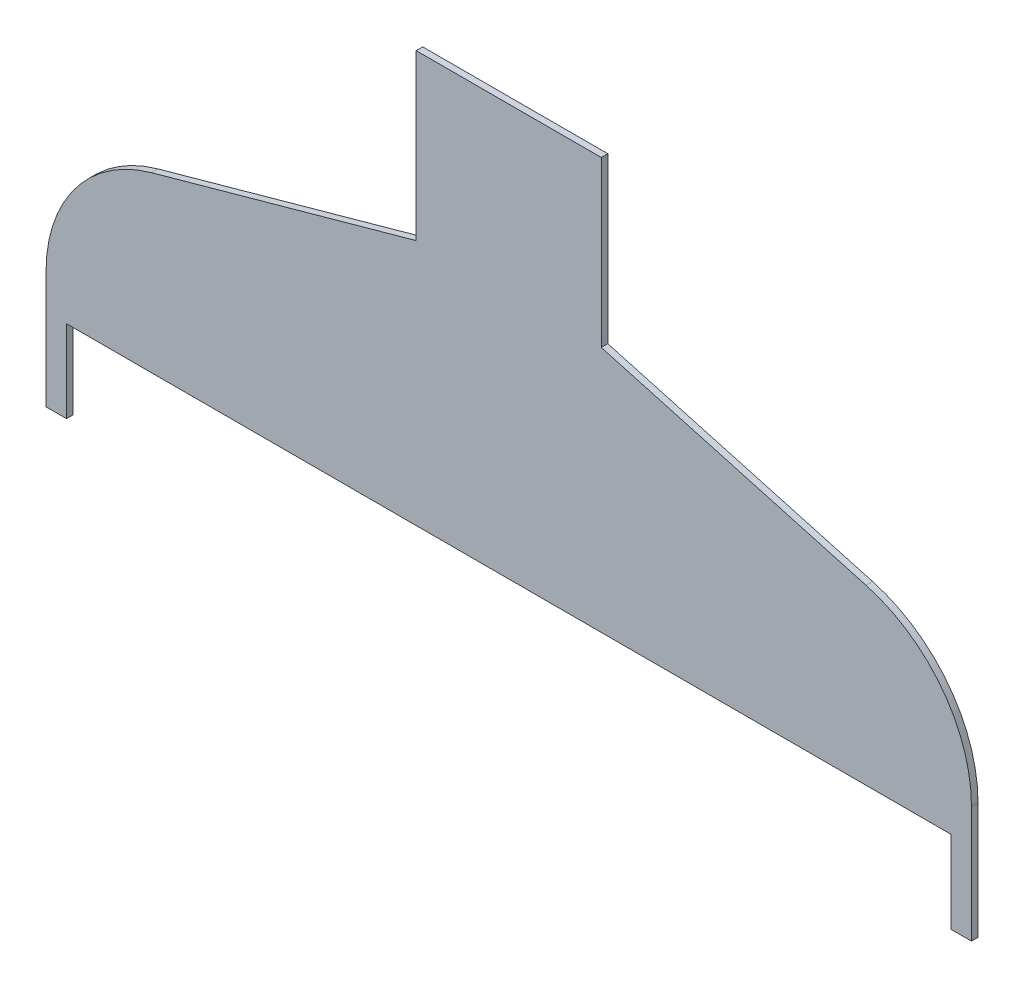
from build123d import *

# Parameters (mm, degrees)
BOSS_EXTRUDE1_DEPTH = 3.175


with BuildPart() as part:
    # Sketch1 → Boss-Extrude1 (new body)
    with BuildSketch(Plane.XY):
        with BuildLine():
            Line((0, -50), (90, -50))
            Line((90, -50), (260, -50))
            Line((260, -50), (260, -90))
            Line((260, -90), (270, -90))
            Line((270, -90), (270, -33.20599547))
            ThreePointArc((270, -33.20599547), (255.729054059, 9.152858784), (218.735070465, 34.240258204))
            Line((218.735070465, 34.240258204), (90, 70))
            Line((90, 70), (90, 150))
            Line((90, 150), (0, 150))
            Line((0, 150), (0, 70))
            Line((0, 70), (-128.735070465, 34.240258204))
            ThreePointArc((-128.735070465, 34.240258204), (-165.729054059, 9.152858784), (-180, -33.20599547))
            Line((-180, -33.20599547), (-180, -90))
            Line((-180, -90), (-170, -90))
            Line((-170, -90), (-170, -50))
            Line((-170, -50), (0, -50))
        make_face()
    extrude(amount=BOSS_EXTRUDE1_DEPTH)


solid = part.part
